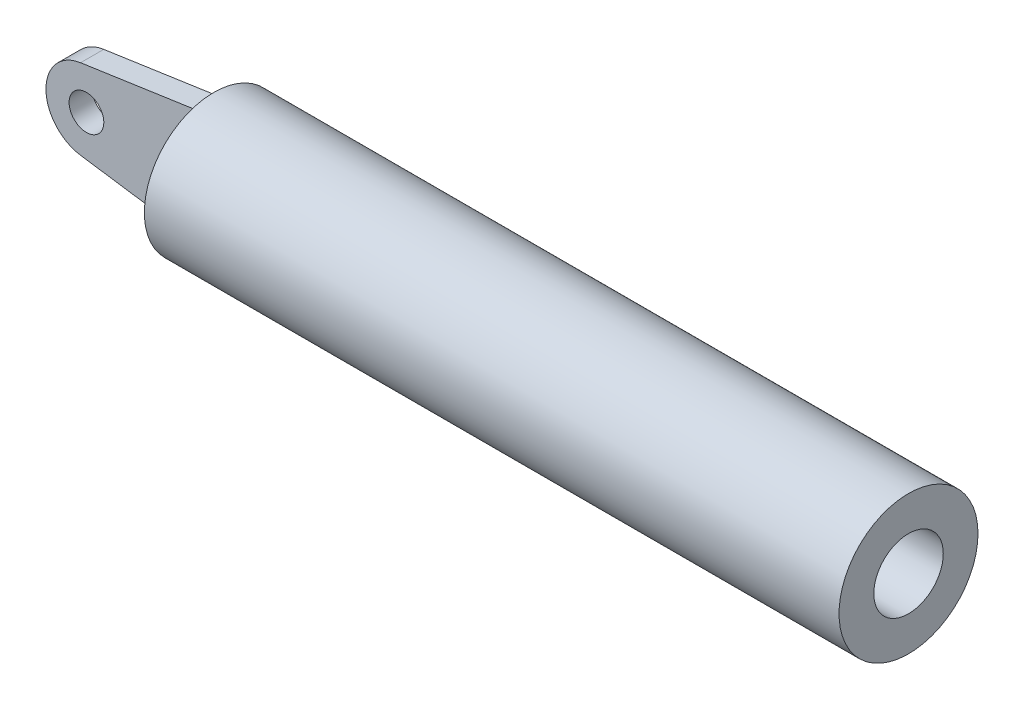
from build123d import *

# Parameters (mm, degrees)
SKETCH1_R           = 60
BOSS_EXTRUDE1_DEPTH = 600
SKETCH2_R           = 30
CUT_EXTRUDE1_DEPTH  = 580
SKETCH3_R           = 15
BOSS_EXTRUDE2_DEPTH = 10


with BuildPart() as part:
    # Sketch1 → Boss-Extrude1 (new body)
    with BuildSketch(Plane(origin=(0, 0, 0), x_dir=(0, 0, -1), z_dir=(1, 0, 0))):
        Circle(SKETCH1_R)
    extrude(amount=BOSS_EXTRUDE1_DEPTH)

    # Sketch2 → Cut-Extrude1 (cut)
    with BuildSketch(Plane(origin=(600, 0, 0), x_dir=(0, 0, -1), z_dir=(1, 0, 0))):
        Circle(SKETCH2_R)
    extrude(amount=-CUT_EXTRUDE1_DEPTH, mode=Mode.SUBTRACT)

    # Sketch3 → Boss-Extrude2 (add, symmetric)
    with BuildSketch(Plane.XY):
        with BuildLine():
            Line((0, -50), (0, 50))
            Line((0, 50), (-105.065732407, 34.631464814))
            ThreePointArc((-105.065732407, 34.631464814), (-135, 0), (-105.065732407, -34.631464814))
            Line((-105.065732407, -34.631464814), (0, -50))
        make_face()
        with Locations((-100, 0)):
            Circle(SKETCH3_R, mode=Mode.SUBTRACT)
    extrude(amount=BOSS_EXTRUDE2_DEPTH, both=True)


solid = part.part
